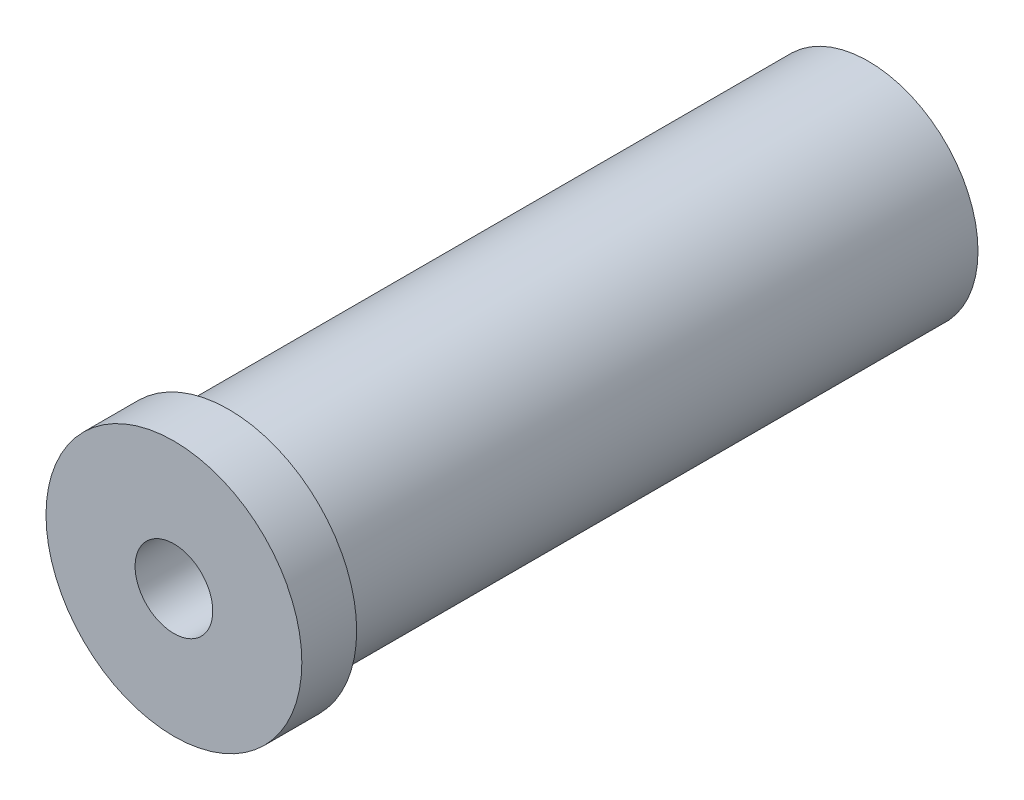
ISO-10303-21;
HEADER;
FILE_DESCRIPTION(('STEP AP214'),'2;1');
FILE_NAME('part.step','',(''),(''),'','','');
FILE_SCHEMA(('AUTOMOTIVE_DESIGN { 1 0 10303 214 1 1 1 1 }'));
ENDSEC;
DATA;
#1=APPLICATION_CONTEXT('core data for automotive mechanical design processes');
#2=APPLICATION_PROTOCOL_DEFINITION('international standard','automotive_design',2000,#1);
#3=PRODUCT_CONTEXT('',#1,'mechanical');
#4=PRODUCT('Part','Part','',(#3));
#5=PRODUCT_RELATED_PRODUCT_CATEGORY('part','',(#4));
#6=PRODUCT_DEFINITION_FORMATION('','',#4);
#7=PRODUCT_DEFINITION_CONTEXT('part definition',#1,'design');
#8=PRODUCT_DEFINITION('design','',#6,#7);
#9=PRODUCT_DEFINITION_SHAPE('','',#8);
#10=(LENGTH_UNIT() NAMED_UNIT(*) SI_UNIT(.MILLI.,.METRE.));
#11=(NAMED_UNIT(*) PLANE_ANGLE_UNIT() SI_UNIT($,.RADIAN.));
#12=(NAMED_UNIT(*) SI_UNIT($,.STERADIAN.) SOLID_ANGLE_UNIT());
#13=UNCERTAINTY_MEASURE_WITH_UNIT(LENGTH_MEASURE(1.E-05),#10,'distance_accuracy_value','');
#14=(GEOMETRIC_REPRESENTATION_CONTEXT(3) GLOBAL_UNCERTAINTY_ASSIGNED_CONTEXT((#13)) GLOBAL_UNIT_ASSIGNED_CONTEXT((#10,
#11,#12)) REPRESENTATION_CONTEXT('',''));
#15=CARTESIAN_POINT('',(0.,0.,0.));
#16=DIRECTION('',(0.,0.,1.));
#17=DIRECTION('',(1.,0.,0.));
#18=AXIS2_PLACEMENT_3D('',#15,#16,#17);
#19=CARTESIAN_POINT('',(0.,4.25,-48.));
#20=DIRECTION('',(0.,0.,-1.));
#21=DIRECTION('',(-1.,0.,0.));
#22=AXIS2_PLACEMENT_3D('',#19,#20,#21);
#23=PLANE('',#22);
#24=CARTESIAN_POINT('',(0.,0.,-48.));
#25=DIRECTION('',(0.,0.,1.));
#26=DIRECTION('',(1.,0.,0.));
#27=AXIS2_PLACEMENT_3D('',#24,#25,#26);
#28=CIRCLE('',#27,4.);
#29=CARTESIAN_POINT('',(4.,0.,-48.));
#30=VERTEX_POINT('',#29);
#31=EDGE_CURVE('E51',#30,#30,#28,.T.);
#32=ORIENTED_EDGE('',*,*,#31,.F.);
#33=EDGE_LOOP('',(#32));
#34=FACE_BOUND('',#33,.T.);
#35=CARTESIAN_POINT('',(0.,0.,-48.));
#36=DIRECTION('',(0.,0.,1.));
#37=DIRECTION('',(1.,0.,0.));
#38=AXIS2_PLACEMENT_3D('',#35,#36,#37);
#39=CIRCLE('',#38,4.25);
#40=CARTESIAN_POINT('',(4.25,0.,-48.));
#41=VERTEX_POINT('',#40);
#42=EDGE_CURVE('E9',#41,#41,#39,.T.);
#43=ORIENTED_EDGE('',*,*,#42,.T.);
#44=EDGE_LOOP('',(#43));
#45=FACE_BOUND('',#44,.T.);
#46=ADVANCED_FACE('F14',(#34,#45),#23,.F.);
#47=CARTESIAN_POINT('',(0.,0.,0.));
#48=DIRECTION('',(0.,0.,1.));
#49=DIRECTION('',(1.,0.,0.));
#50=AXIS2_PLACEMENT_3D('',#47,#48,#49);
#51=CYLINDRICAL_SURFACE('',#50,4.25);
#52=ORIENTED_EDGE('',*,*,#42,.F.);
#53=EDGE_LOOP('',(#52));
#54=FACE_BOUND('',#53,.T.);
#55=CARTESIAN_POINT('',(0.,0.,0.));
#56=DIRECTION('',(0.,0.,1.));
#57=DIRECTION('',(1.,0.,0.));
#58=AXIS2_PLACEMENT_3D('',#55,#56,#57);
#59=CIRCLE('',#58,4.25);
#60=CARTESIAN_POINT('',(4.25,0.,0.));
#61=VERTEX_POINT('',#60);
#62=EDGE_CURVE('E20',#61,#61,#59,.T.);
#63=ORIENTED_EDGE('',*,*,#62,.T.);
#64=EDGE_LOOP('',(#63));
#65=FACE_BOUND('',#64,.T.);
#66=ADVANCED_FACE('F58',(#54,#65),#51,.F.);
#67=CARTESIAN_POINT('',(0.,4.25,0.));
#68=DIRECTION('',(0.,0.,-1.));
#69=DIRECTION('',(-1.,0.,0.));
#70=AXIS2_PLACEMENT_3D('',#67,#68,#69);
#71=PLANE('',#70);
#72=ORIENTED_EDGE('',*,*,#62,.F.);
#73=EDGE_LOOP('',(#72));
#74=FACE_BOUND('',#73,.T.);
#75=CARTESIAN_POINT('',(0.,0.,0.));
#76=DIRECTION('',(0.,0.,1.));
#77=DIRECTION('',(1.,0.,0.));
#78=AXIS2_PLACEMENT_3D('',#75,#76,#77);
#79=CIRCLE('',#78,14.);
#80=CARTESIAN_POINT('',(14.,0.,0.));
#81=VERTEX_POINT('',#80);
#82=EDGE_CURVE('E24',#81,#81,#79,.T.);
#83=ORIENTED_EDGE('',*,*,#82,.T.);
#84=EDGE_LOOP('',(#83));
#85=FACE_BOUND('',#84,.T.);
#86=ADVANCED_FACE('F64',(#74,#85),#71,.F.);
#87=CARTESIAN_POINT('',(0.,0.,0.));
#88=DIRECTION('',(0.,0.,1.));
#89=DIRECTION('',(1.,0.,0.));
#90=AXIS2_PLACEMENT_3D('',#87,#88,#89);
#91=CYLINDRICAL_SURFACE('',#90,14.);
#92=ORIENTED_EDGE('',*,*,#82,.F.);
#93=EDGE_LOOP('',(#92));
#94=FACE_BOUND('',#93,.T.);
#95=CARTESIAN_POINT('',(0.,0.,-6.));
#96=DIRECTION('',(0.,0.,1.));
#97=DIRECTION('',(1.,0.,0.));
#98=AXIS2_PLACEMENT_3D('',#95,#96,#97);
#99=CIRCLE('',#98,14.);
#100=CARTESIAN_POINT('',(14.,0.,-6.));
#101=VERTEX_POINT('',#100);
#102=EDGE_CURVE('E28',#101,#101,#99,.T.);
#103=ORIENTED_EDGE('',*,*,#102,.T.);
#104=EDGE_LOOP('',(#103));
#105=FACE_BOUND('',#104,.T.);
#106=ADVANCED_FACE('F70',(#94,#105),#91,.T.);
#107=CARTESIAN_POINT('',(0.,14.,-6.));
#108=DIRECTION('',(0.,0.,1.));
#109=DIRECTION('',(1.,0.,0.));
#110=AXIS2_PLACEMENT_3D('',#107,#108,#109);
#111=PLANE('',#110);
#112=ORIENTED_EDGE('',*,*,#102,.F.);
#113=EDGE_LOOP('',(#112));
#114=FACE_BOUND('',#113,.T.);
#115=CARTESIAN_POINT('',(0.,0.,-6.));
#116=DIRECTION('',(0.,0.,1.));
#117=DIRECTION('',(1.,0.,0.));
#118=AXIS2_PLACEMENT_3D('',#115,#116,#117);
#119=CIRCLE('',#118,12.);
#120=CARTESIAN_POINT('',(12.,0.,-6.));
#121=VERTEX_POINT('',#120);
#122=EDGE_CURVE('E33',#121,#121,#119,.T.);
#123=ORIENTED_EDGE('',*,*,#122,.T.);
#124=EDGE_LOOP('',(#123));
#125=FACE_BOUND('',#124,.T.);
#126=ADVANCED_FACE('F76',(#114,#125),#111,.F.);
#127=CARTESIAN_POINT('',(0.,0.,0.));
#128=DIRECTION('',(0.,0.,1.));
#129=DIRECTION('',(1.,0.,0.));
#130=AXIS2_PLACEMENT_3D('',#127,#128,#129);
#131=CYLINDRICAL_SURFACE('',#130,12.);
#132=ORIENTED_EDGE('',*,*,#122,.F.);
#133=EDGE_LOOP('',(#132));
#134=FACE_BOUND('',#133,.T.);
#135=CARTESIAN_POINT('',(0.,0.,-76.));
#136=DIRECTION('',(0.,0.,1.));
#137=DIRECTION('',(1.,0.,0.));
#138=AXIS2_PLACEMENT_3D('',#135,#136,#137);
#139=CIRCLE('',#138,12.);
#140=CARTESIAN_POINT('',(12.,0.,-76.));
#141=VERTEX_POINT('',#140);
#142=EDGE_CURVE('E36',#141,#141,#139,.T.);
#143=ORIENTED_EDGE('',*,*,#142,.T.);
#144=EDGE_LOOP('',(#143));
#145=FACE_BOUND('',#144,.T.);
#146=ADVANCED_FACE('F80',(#134,#145),#131,.T.);
#147=CARTESIAN_POINT('',(0.,12.,-76.));
#148=DIRECTION('',(0.,0.,1.));
#149=DIRECTION('',(1.,0.,0.));
#150=AXIS2_PLACEMENT_3D('',#147,#148,#149);
#151=PLANE('',#150);
#152=ORIENTED_EDGE('',*,*,#142,.F.);
#153=EDGE_LOOP('',(#152));
#154=FACE_BOUND('',#153,.T.);
#155=CARTESIAN_POINT('',(0.,0.,-76.));
#156=DIRECTION('',(0.,0.,1.));
#157=DIRECTION('',(1.,0.,0.));
#158=AXIS2_PLACEMENT_3D('',#155,#156,#157);
#159=CIRCLE('',#158,4.25);
#160=CARTESIAN_POINT('',(4.25,0.,-76.));
#161=VERTEX_POINT('',#160);
#162=EDGE_CURVE('E39',#161,#161,#159,.T.);
#163=ORIENTED_EDGE('',*,*,#162,.T.);
#164=EDGE_LOOP('',(#163));
#165=FACE_BOUND('',#164,.T.);
#166=ADVANCED_FACE('F84',(#154,#165),#151,.F.);
#167=CARTESIAN_POINT('',(0.,0.,0.));
#168=DIRECTION('',(0.,0.,1.));
#169=DIRECTION('',(1.,0.,0.));
#170=AXIS2_PLACEMENT_3D('',#167,#168,#169);
#171=CYLINDRICAL_SURFACE('',#170,4.25);
#172=ORIENTED_EDGE('',*,*,#162,.F.);
#173=EDGE_LOOP('',(#172));
#174=FACE_BOUND('',#173,.T.);
#175=CARTESIAN_POINT('',(0.,0.,-74.));
#176=DIRECTION('',(0.,0.,1.));
#177=DIRECTION('',(1.,0.,0.));
#178=AXIS2_PLACEMENT_3D('',#175,#176,#177);
#179=CIRCLE('',#178,4.25);
#180=CARTESIAN_POINT('',(4.25,0.,-74.));
#181=VERTEX_POINT('',#180);
#182=EDGE_CURVE('E42',#181,#181,#179,.T.);
#183=ORIENTED_EDGE('',*,*,#182,.T.);
#184=EDGE_LOOP('',(#183));
#185=FACE_BOUND('',#184,.T.);
#186=ADVANCED_FACE('F88',(#174,#185),#171,.F.);
#187=CARTESIAN_POINT('',(0.,0.,-66.5));
#188=DIRECTION('',(0.,0.,1.));
#189=DIRECTION('',(1.,0.,0.));
#190=AXIS2_PLACEMENT_3D('',#187,#188,#189);
#191=CONICAL_SURFACE('',#190,4.90616497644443,0.0872664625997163);
#192=ORIENTED_EDGE('',*,*,#182,.F.);
#193=EDGE_LOOP('',(#192));
#194=FACE_BOUND('',#193,.T.);
#195=CARTESIAN_POINT('',(0.,0.,-66.5));
#196=DIRECTION('',(0.,0.,1.));
#197=DIRECTION('',(1.,0.,0.));
#198=AXIS2_PLACEMENT_3D('',#195,#196,#197);
#199=CIRCLE('',#198,4.90616497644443);
#200=CARTESIAN_POINT('',(4.90616497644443,0.,-66.5));
#201=VERTEX_POINT('',#200);
#202=EDGE_CURVE('E45',#201,#201,#199,.T.);
#203=ORIENTED_EDGE('',*,*,#202,.T.);
#204=EDGE_LOOP('',(#203));
#205=FACE_BOUND('',#204,.T.);
#206=ADVANCED_FACE('F92',(#194,#205),#191,.F.);
#207=CARTESIAN_POINT('',(0.,4.90616497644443,-66.5));
#208=DIRECTION('',(0.,0.,1.));
#209=DIRECTION('',(1.,0.,0.));
#210=AXIS2_PLACEMENT_3D('',#207,#208,#209);
#211=PLANE('',#210);
#212=ORIENTED_EDGE('',*,*,#202,.F.);
#213=EDGE_LOOP('',(#212));
#214=FACE_BOUND('',#213,.T.);
#215=CARTESIAN_POINT('',(0.,0.,-66.5));
#216=DIRECTION('',(0.,0.,1.));
#217=DIRECTION('',(1.,0.,0.));
#218=AXIS2_PLACEMENT_3D('',#215,#216,#217);
#219=CIRCLE('',#218,4.);
#220=CARTESIAN_POINT('',(4.,0.,-66.5));
#221=VERTEX_POINT('',#220);
#222=EDGE_CURVE('E48',#221,#221,#219,.T.);
#223=ORIENTED_EDGE('',*,*,#222,.T.);
#224=EDGE_LOOP('',(#223));
#225=FACE_BOUND('',#224,.T.);
#226=ADVANCED_FACE('F96',(#214,#225),#211,.F.);
#227=CARTESIAN_POINT('',(0.,0.,0.));
#228=DIRECTION('',(0.,0.,1.));
#229=DIRECTION('',(1.,0.,0.));
#230=AXIS2_PLACEMENT_3D('',#227,#228,#229);
#231=CYLINDRICAL_SURFACE('',#230,4.);
#232=ORIENTED_EDGE('',*,*,#222,.F.);
#233=EDGE_LOOP('',(#232));
#234=FACE_BOUND('',#233,.T.);
#235=ORIENTED_EDGE('',*,*,#31,.T.);
#236=EDGE_LOOP('',(#235));
#237=FACE_BOUND('',#236,.T.);
#238=ADVANCED_FACE('F55',(#234,#237),#231,.F.);
#239=CLOSED_SHELL('',(#46,#66,#86,#106,#126,#146,#166,#186,#206,#226,#238));
#240=MANIFOLD_SOLID_BREP('B1',#239);
#241=ADVANCED_BREP_SHAPE_REPRESENTATION('',(#18,#240),#14);
#242=SHAPE_DEFINITION_REPRESENTATION(#9,#241);
ENDSEC;
END-ISO-10303-21;
